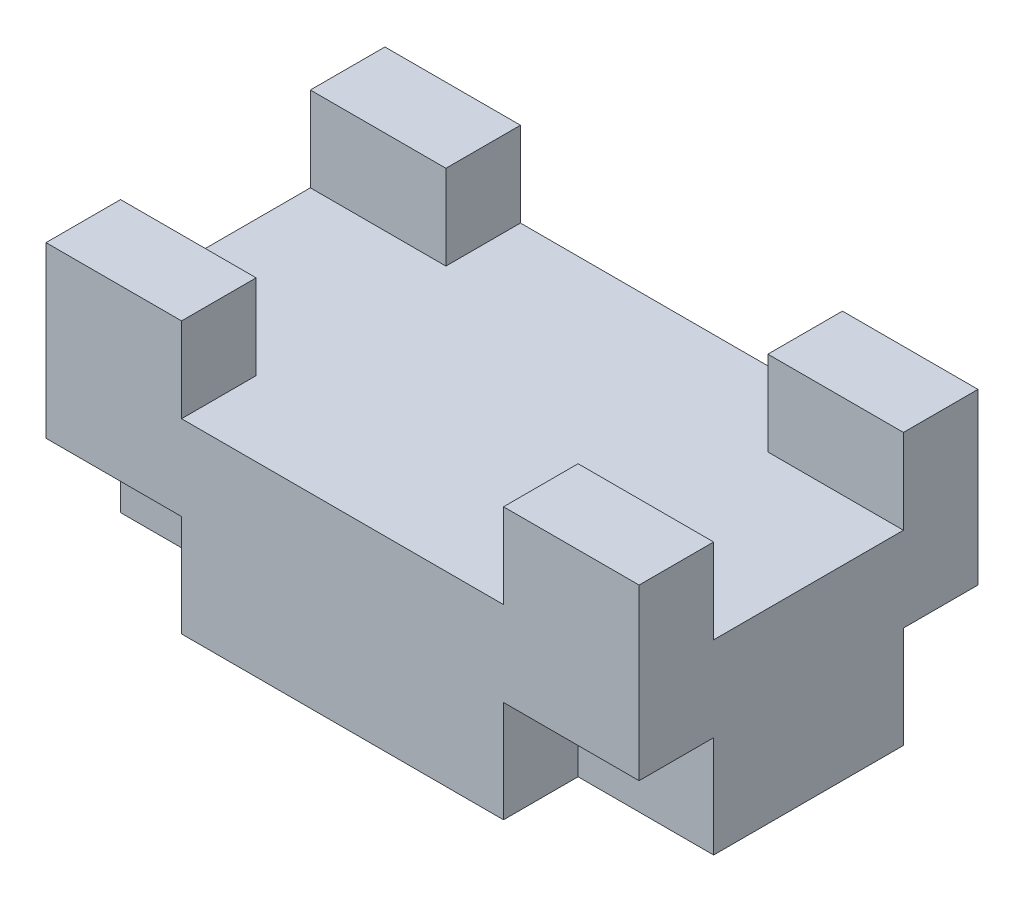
from build123d import *

# Parameters (mm, degrees)
SKETCH1_W           = 175
SKETCH1_H           = 100
BOSS_EXTRUDE1_DEPTH = 25
SKETCH2_W           = 40
SKETCH2_H           = 22
BOSS_EXTRUDE2_DEPTH = 25
SKETCH1_2_W         = 175
SKETCH1_2_H         = 100
BOSS_EXTRUDE3_DEPTH = 30
SKETCH4_W           = 40
SKETCH4_H           = 22
CUT_EXTRUDE1_DEPTH  = 30


with BuildPart() as part:
    # Sketch1 → Boss-Extrude1 (new body)
    with BuildSketch(Plane(origin=(0, 0, 0), x_dir=(1, 0, 0), z_dir=(0, 1, 0))):
        Rectangle(SKETCH1_W, SKETCH1_H)
    extrude(amount=BOSS_EXTRUDE1_DEPTH)

    # Sketch2 → Boss-Extrude2 (add)
    with BuildSketch(Plane(origin=(0, 25, 0), x_dir=(1, 0, 0), z_dir=(0, 1, 0))):
        with Locations((67.5, 39)):
            Rectangle(SKETCH2_W, SKETCH2_H)
        with Locations((-67.5, 39)):
            Rectangle(SKETCH2_W, SKETCH2_H)
        with Locations((-67.5, -39)):
            Rectangle(SKETCH2_W, SKETCH2_H)
        with Locations((67.5, -39)):
            Rectangle(SKETCH2_W, SKETCH2_H)
    extrude(amount=BOSS_EXTRUDE2_DEPTH)

    # Sketch1_2 → Boss-Extrude3 (add)
    with BuildSketch(Plane(origin=(0, 0, 0), x_dir=(1, 0, 0), z_dir=(0, 1, 0))):
        Rectangle(SKETCH1_2_W, SKETCH1_2_H)
    extrude(amount=-BOSS_EXTRUDE3_DEPTH)

    # Sketch4 → Cut-Extrude1 (cut)
    with BuildSketch(Plane.XZ.offset(30)):
        with Locations((-67.5, 39)):
            Rectangle(SKETCH4_W, SKETCH4_H)
        with Locations((-67.5, -39)):
            Rectangle(SKETCH4_W, SKETCH4_H)
        with Locations((67.5, 39)):
            Rectangle(SKETCH4_W, SKETCH4_H)
        with Locations((67.5, -39)):
            Rectangle(SKETCH4_W, SKETCH4_H)
    extrude(amount=-CUT_EXTRUDE1_DEPTH, mode=Mode.SUBTRACT)


solid = part.part
